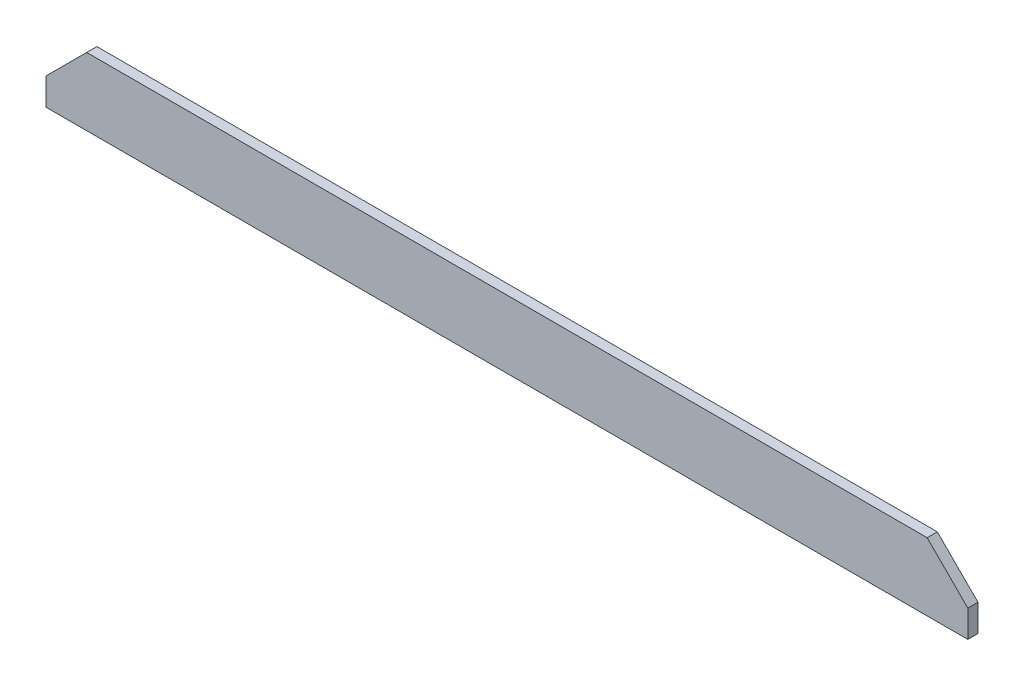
from build123d import *

# Parameters (mm, degrees)
SKETCH1_W      = 863.6
SKETCH1_H      = 63.5
EXTRUDE1_DEPTH = 9.525
CHAMFER1_SIZE  = 38.1
CHAMFER2_SIZE  = 38.1


with BuildPart() as part:
    # Sketch1 → Extrude1 (new body)
    with BuildSketch(Plane.XY):
        with Locations((431.8, -31.75)):
            Rectangle(SKETCH1_W, SKETCH1_H)
    extrude(amount=-EXTRUDE1_DEPTH)

    # Chamfer1
    chamfer1_edges = [part.edges().sort_by_distance(p)[0] for p in [
        (0, 0, -4.7625),
    ]]
    chamfer(chamfer1_edges, length=CHAMFER1_SIZE)

    # Chamfer2
    chamfer2_edges = [part.edges().sort_by_distance(p)[0] for p in [
        (863.6, 0, -4.7625),
    ]]
    chamfer(chamfer2_edges, length=CHAMFER2_SIZE)


solid = part.part
